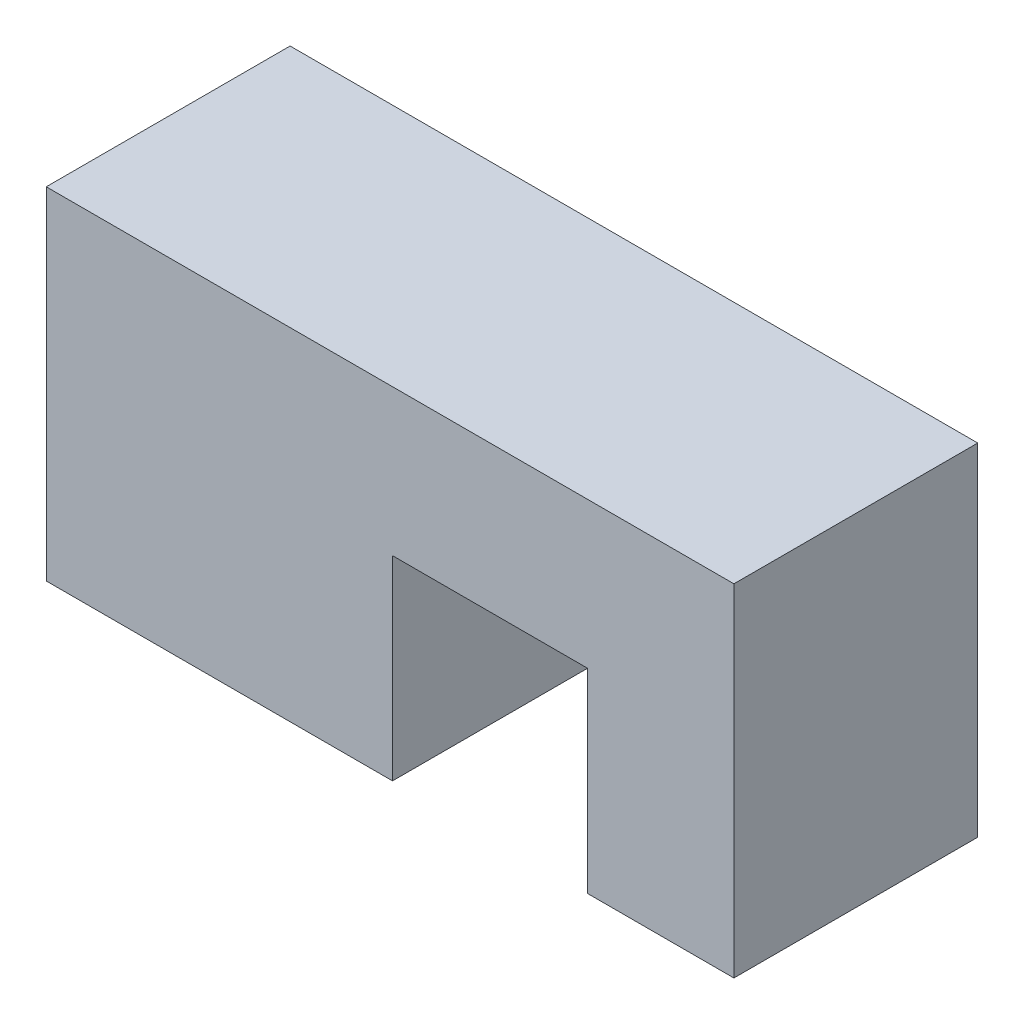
from build123d import *

# Parameters (mm, degrees)
BOSS_EXTRUDE1_DEPTH = 25


with BuildPart() as part:
    # Sketch1 → Boss-Extrude1 (new body)
    with BuildSketch(Plane.XY):
        Polygon((0, 0), (0, 20), (20, 20), (20, 0), (35, 0), (35, 35), (20, 35), (-35.5, 35), (-35.5, 0), align=None)
    extrude(amount=BOSS_EXTRUDE1_DEPTH)


solid = part.part
